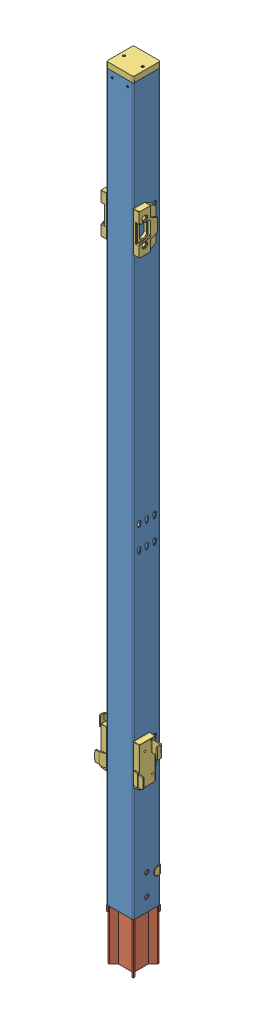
SolidWorks assembly E13-190.sldasm, configuration Default (file format 4400). Lengths in mm.
Overall size (150.99 2032.5 74.3).
3 component instances, 3 part files, 0 mates.
Components (placement in the parent):
- P03-XXX(1885)-1: P03-XXX(1885).sldprt [Default] at origin size (70 1885 70)
- B00-042-KR-1-1: B00-042-KR-1.sldprt [Default] at (0 -7.5 0) size (70 250 70)
- A-0025004-1: A-0025004.sldprt [Default] at (0 -100 0) size (150.99 1831.48 74.3)
